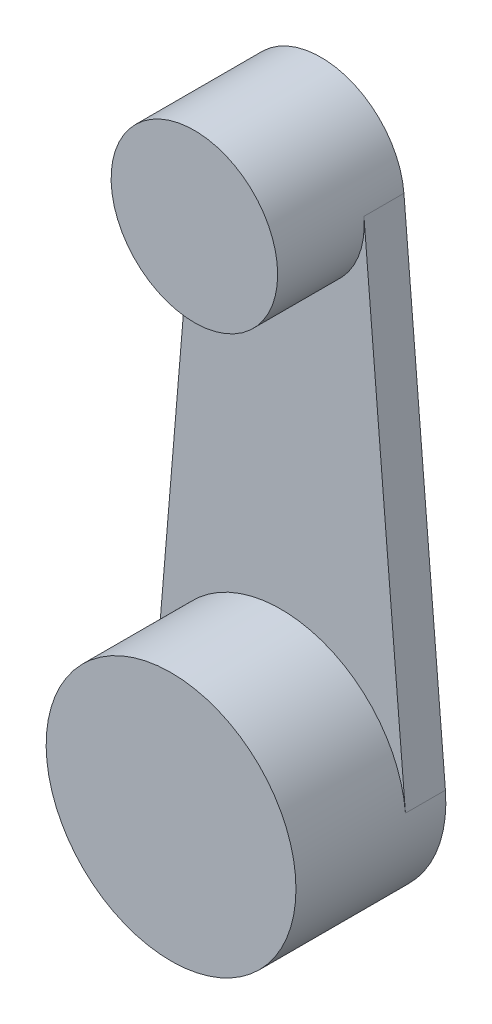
ISO-10303-21;
HEADER;
FILE_DESCRIPTION(('STEP AP214'),'2;1');
FILE_NAME('part.step','',(''),(''),'','','');
FILE_SCHEMA(('AUTOMOTIVE_DESIGN { 1 0 10303 214 1 1 1 1 }'));
ENDSEC;
DATA;
#1=APPLICATION_CONTEXT('core data for automotive mechanical design processes');
#2=APPLICATION_PROTOCOL_DEFINITION('international standard','automotive_design',2000,#1);
#3=PRODUCT_CONTEXT('',#1,'mechanical');
#4=PRODUCT('Part','Part','',(#3));
#5=PRODUCT_RELATED_PRODUCT_CATEGORY('part','',(#4));
#6=PRODUCT_DEFINITION_FORMATION('','',#4);
#7=PRODUCT_DEFINITION_CONTEXT('part definition',#1,'design');
#8=PRODUCT_DEFINITION('design','',#6,#7);
#9=PRODUCT_DEFINITION_SHAPE('','',#8);
#10=(LENGTH_UNIT() NAMED_UNIT(*) SI_UNIT(.MILLI.,.METRE.));
#11=(NAMED_UNIT(*) PLANE_ANGLE_UNIT() SI_UNIT($,.RADIAN.));
#12=(NAMED_UNIT(*) SI_UNIT($,.STERADIAN.) SOLID_ANGLE_UNIT());
#13=UNCERTAINTY_MEASURE_WITH_UNIT(LENGTH_MEASURE(1.E-05),#10,'distance_accuracy_value','');
#14=(GEOMETRIC_REPRESENTATION_CONTEXT(3) GLOBAL_UNCERTAINTY_ASSIGNED_CONTEXT((#13)) GLOBAL_UNIT_ASSIGNED_CONTEXT((#10,
#11,#12)) REPRESENTATION_CONTEXT('',''));
#15=CARTESIAN_POINT('',(0.,0.,0.));
#16=DIRECTION('',(0.,0.,1.));
#17=DIRECTION('',(1.,0.,0.));
#18=AXIS2_PLACEMENT_3D('',#15,#16,#17);
#19=CARTESIAN_POINT('',(0.,0.,45.));
#20=DIRECTION('',(0.,0.,-1.));
#21=DIRECTION('',(-1.,0.,0.));
#22=AXIS2_PLACEMENT_3D('',#19,#20,#21);
#23=CYLINDRICAL_SURFACE('',#22,37.5);
#24=CARTESIAN_POINT('',(0.,0.,12.));
#25=DIRECTION('',(0.,0.,1.));
#26=DIRECTION('',(1.,0.,0.));
#27=AXIS2_PLACEMENT_3D('',#24,#25,#26);
#28=CIRCLE('',#27,37.5);
#29=CARTESIAN_POINT('',(37.3695648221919,3.125,12.));
#30=VERTEX_POINT('',#29);
#31=CARTESIAN_POINT('',(-37.3695648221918,3.125,12.));
#32=VERTEX_POINT('',#31);
#33=EDGE_CURVE('E48',#30,#32,#28,.T.);
#34=ORIENTED_EDGE('',*,*,#33,.T.);
#35=DIRECTION('',(0.,0.,-1.));
#36=VECTOR('',#35,1.);
#37=CARTESIAN_POINT('',(-37.3695648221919,3.125,12.));
#38=LINE('',#37,#36);
#39=CARTESIAN_POINT('',(-37.3695648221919,3.125,0.));
#40=VERTEX_POINT('',#39);
#41=EDGE_CURVE('E106',#32,#40,#38,.T.);
#42=ORIENTED_EDGE('',*,*,#41,.T.);
#43=CARTESIAN_POINT('',(0.,0.,0.));
#44=DIRECTION('',(0.,0.,1.));
#45=DIRECTION('',(1.,0.,0.));
#46=AXIS2_PLACEMENT_3D('',#43,#44,#45);
#47=CIRCLE('',#46,37.5);
#48=CARTESIAN_POINT('',(37.3695648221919,3.125,0.));
#49=VERTEX_POINT('',#48);
#50=EDGE_CURVE('E37',#40,#49,#47,.T.);
#51=ORIENTED_EDGE('',*,*,#50,.T.);
#52=DIRECTION('',(0.,0.,-1.));
#53=VECTOR('',#52,1.);
#54=CARTESIAN_POINT('',(37.3695648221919,3.125,12.));
#55=LINE('',#54,#53);
#56=EDGE_CURVE('E53',#30,#49,#55,.T.);
#57=ORIENTED_EDGE('',*,*,#56,.F.);
#58=EDGE_LOOP('',(#34,#42,#51,#57));
#59=FACE_BOUND('',#58,.T.);
#60=CARTESIAN_POINT('',(0.,0.,45.));
#61=DIRECTION('',(0.,0.,1.));
#62=DIRECTION('',(1.,0.,0.));
#63=AXIS2_PLACEMENT_3D('',#60,#61,#62);
#64=CIRCLE('',#63,37.5);
#65=CARTESIAN_POINT('',(37.5,0.,45.));
#66=VERTEX_POINT('',#65);
#67=EDGE_CURVE('E11',#66,#66,#64,.T.);
#68=ORIENTED_EDGE('',*,*,#67,.F.);
#69=EDGE_LOOP('',(#68));
#70=FACE_BOUND('',#69,.T.);
#71=ADVANCED_FACE('F34',(#59,#70),#23,.T.);
#72=CARTESIAN_POINT('',(0.,0.,45.));
#73=DIRECTION('',(0.,0.,1.));
#74=DIRECTION('',(1.,0.,0.));
#75=AXIS2_PLACEMENT_3D('',#72,#73,#74);
#76=PLANE('',#75);
#77=ORIENTED_EDGE('',*,*,#67,.T.);
#78=EDGE_LOOP('',(#77));
#79=FACE_BOUND('',#78,.T.);
#80=ADVANCED_FACE('F128',(#79),#76,.T.);
#81=CARTESIAN_POINT('',(0.,0.,0.));
#82=DIRECTION('',(0.,0.,1.));
#83=DIRECTION('',(1.,0.,0.));
#84=AXIS2_PLACEMENT_3D('',#81,#82,#83);
#85=PLANE('',#84);
#86=ORIENTED_EDGE('',*,*,#50,.F.);
#87=DIRECTION('',(-0.0833333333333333,-0.996521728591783,0.));
#88=VECTOR('',#87,1.);
#89=CARTESIAN_POINT('',(-37.3695648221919,3.125,0.));
#90=LINE('',#89,#88);
#91=CARTESIAN_POINT('',(-24.9130432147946,152.083333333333,0.));
#92=VERTEX_POINT('',#91);
#93=EDGE_CURVE('E95',#92,#40,#90,.T.);
#94=ORIENTED_EDGE('',*,*,#93,.F.);
#95=CARTESIAN_POINT('',(0.,150.,0.));
#96=DIRECTION('',(0.,0.,1.));
#97=DIRECTION('',(1.,0.,0.));
#98=AXIS2_PLACEMENT_3D('',#95,#96,#97);
#99=CIRCLE('',#98,25.);
#100=CARTESIAN_POINT('',(24.9130432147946,152.083333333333,0.));
#101=VERTEX_POINT('',#100);
#102=EDGE_CURVE('E98',#101,#92,#99,.T.);
#103=ORIENTED_EDGE('',*,*,#102,.F.);
#104=DIRECTION('',(0.0833333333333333,-0.996521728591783,0.));
#105=VECTOR('',#104,1.);
#106=CARTESIAN_POINT('',(37.3695648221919,3.125,0.));
#107=LINE('',#106,#105);
#108=EDGE_CURVE('E85',#101,#49,#107,.T.);
#109=ORIENTED_EDGE('',*,*,#108,.T.);
#110=EDGE_LOOP('',(#86,#94,#103,#109));
#111=FACE_BOUND('',#110,.T.);
#112=ADVANCED_FACE('F113',(#111),#85,.F.);
#113=CARTESIAN_POINT('',(-37.3695648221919,3.125,12.));
#114=DIRECTION('',(0.996521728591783,-0.0833333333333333,0.));
#115=DIRECTION('',(0.0833333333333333,0.996521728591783,0.));
#116=AXIS2_PLACEMENT_3D('',#113,#114,#115);
#117=PLANE('',#116);
#118=ORIENTED_EDGE('',*,*,#93,.T.);
#119=ORIENTED_EDGE('',*,*,#41,.F.);
#120=DIRECTION('',(-0.0833333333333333,-0.996521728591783,0.));
#121=VECTOR('',#120,1.);
#122=CARTESIAN_POINT('',(-37.3695648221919,3.125,12.));
#123=LINE('',#122,#121);
#124=CARTESIAN_POINT('',(-24.9130432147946,152.083333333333,12.));
#125=VERTEX_POINT('',#124);
#126=EDGE_CURVE('E92',#125,#32,#123,.T.);
#127=ORIENTED_EDGE('',*,*,#126,.F.);
#128=DIRECTION('',(0.,0.,-1.));
#129=VECTOR('',#128,1.);
#130=CARTESIAN_POINT('',(-24.9130432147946,152.083333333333,12.));
#131=LINE('',#130,#129);
#132=EDGE_CURVE('E91',#125,#92,#131,.T.);
#133=ORIENTED_EDGE('',*,*,#132,.T.);
#134=EDGE_LOOP('',(#118,#119,#127,#133));
#135=FACE_BOUND('',#134,.T.);
#136=ADVANCED_FACE('F137',(#135),#117,.F.);
#137=CARTESIAN_POINT('',(37.3695648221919,3.125,12.));
#138=DIRECTION('',(0.996521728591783,0.0833333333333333,0.));
#139=DIRECTION('',(-0.0833333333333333,0.996521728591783,0.));
#140=AXIS2_PLACEMENT_3D('',#137,#138,#139);
#141=PLANE('',#140);
#142=ORIENTED_EDGE('',*,*,#108,.F.);
#143=DIRECTION('',(0.,0.,-1.));
#144=VECTOR('',#143,1.);
#145=CARTESIAN_POINT('',(24.9130432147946,152.083333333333,12.));
#146=LINE('',#145,#144);
#147=CARTESIAN_POINT('',(24.9130432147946,152.083333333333,12.));
#148=VERTEX_POINT('',#147);
#149=EDGE_CURVE('E80',#148,#101,#146,.T.);
#150=ORIENTED_EDGE('',*,*,#149,.F.);
#151=DIRECTION('',(0.0833333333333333,-0.996521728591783,0.));
#152=VECTOR('',#151,1.);
#153=CARTESIAN_POINT('',(37.3695648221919,3.125,12.));
#154=LINE('',#153,#152);
#155=EDGE_CURVE('E73',#148,#30,#154,.T.);
#156=ORIENTED_EDGE('',*,*,#155,.T.);
#157=ORIENTED_EDGE('',*,*,#56,.T.);
#158=EDGE_LOOP('',(#142,#150,#156,#157));
#159=FACE_BOUND('',#158,.T.);
#160=ADVANCED_FACE('F83',(#159),#141,.T.);
#161=CARTESIAN_POINT('',(0.,0.,12.));
#162=DIRECTION('',(0.,0.,1.));
#163=DIRECTION('',(1.,0.,0.));
#164=AXIS2_PLACEMENT_3D('',#161,#162,#163);
#165=PLANE('',#164);
#166=CARTESIAN_POINT('',(0.,150.,12.));
#167=DIRECTION('',(0.,0.,1.));
#168=DIRECTION('',(1.,0.,0.));
#169=AXIS2_PLACEMENT_3D('',#166,#167,#168);
#170=CIRCLE('',#169,25.);
#171=EDGE_CURVE('E77',#125,#148,#170,.T.);
#172=ORIENTED_EDGE('',*,*,#171,.F.);
#173=ORIENTED_EDGE('',*,*,#126,.T.);
#174=ORIENTED_EDGE('',*,*,#33,.F.);
#175=ORIENTED_EDGE('',*,*,#155,.F.);
#176=EDGE_LOOP('',(#172,#173,#174,#175));
#177=FACE_BOUND('',#176,.T.);
#178=ADVANCED_FACE('F75',(#177),#165,.T.);
#179=CARTESIAN_POINT('',(0.,150.,38.));
#180=DIRECTION('',(0.,0.,-1.));
#181=DIRECTION('',(-1.,0.,0.));
#182=AXIS2_PLACEMENT_3D('',#179,#180,#181);
#183=CYLINDRICAL_SURFACE('',#182,25.);
#184=CARTESIAN_POINT('',(0.,150.,38.));
#185=DIRECTION('',(0.,0.,1.));
#186=DIRECTION('',(1.,0.,0.));
#187=AXIS2_PLACEMENT_3D('',#184,#185,#186);
#188=CIRCLE('',#187,25.);
#189=CARTESIAN_POINT('',(25.,150.,38.));
#190=VERTEX_POINT('',#189);
#191=EDGE_CURVE('E103',#190,#190,#188,.T.);
#192=ORIENTED_EDGE('',*,*,#191,.F.);
#193=EDGE_LOOP('',(#192));
#194=FACE_BOUND('',#193,.T.);
#195=ORIENTED_EDGE('',*,*,#102,.T.);
#196=ORIENTED_EDGE('',*,*,#132,.F.);
#197=ORIENTED_EDGE('',*,*,#171,.T.);
#198=ORIENTED_EDGE('',*,*,#149,.T.);
#199=EDGE_LOOP('',(#195,#196,#197,#198));
#200=FACE_BOUND('',#199,.T.);
#201=ADVANCED_FACE('F90',(#194,#200),#183,.T.);
#202=CARTESIAN_POINT('',(0.,0.,38.));
#203=DIRECTION('',(0.,0.,1.));
#204=DIRECTION('',(1.,0.,0.));
#205=AXIS2_PLACEMENT_3D('',#202,#203,#204);
#206=PLANE('',#205);
#207=ORIENTED_EDGE('',*,*,#191,.T.);
#208=EDGE_LOOP('',(#207));
#209=FACE_BOUND('',#208,.T.);
#210=ADVANCED_FACE('F117',(#209),#206,.T.);
#211=CLOSED_SHELL('',(#71,#80,#112,#136,#160,#178,#201,#210));
#212=MANIFOLD_SOLID_BREP('B2',#211);
#213=ADVANCED_BREP_SHAPE_REPRESENTATION('',(#18,#212),#14);
#214=SHAPE_DEFINITION_REPRESENTATION(#9,#213);
ENDSEC;
END-ISO-10303-21;
